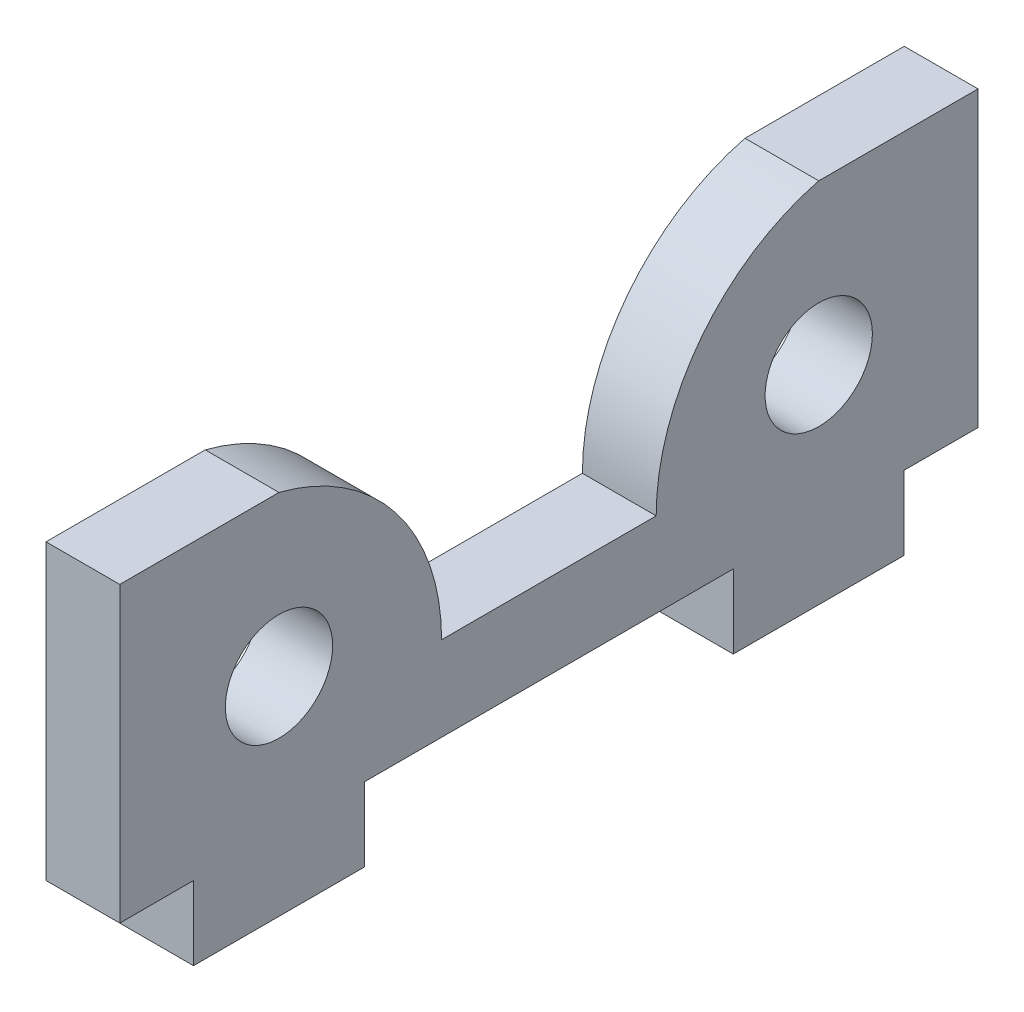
ISO-10303-21;
HEADER;
FILE_DESCRIPTION(('STEP AP214'),'2;1');
FILE_NAME('part.step','',(''),(''),'','','');
FILE_SCHEMA(('AUTOMOTIVE_DESIGN { 1 0 10303 214 1 1 1 1 }'));
ENDSEC;
DATA;
#1=APPLICATION_CONTEXT('core data for automotive mechanical design processes');
#2=APPLICATION_PROTOCOL_DEFINITION('international standard','automotive_design',2000,#1);
#3=PRODUCT_CONTEXT('',#1,'mechanical');
#4=PRODUCT('Part','Part','',(#3));
#5=PRODUCT_RELATED_PRODUCT_CATEGORY('part','',(#4));
#6=PRODUCT_DEFINITION_FORMATION('','',#4);
#7=PRODUCT_DEFINITION_CONTEXT('part definition',#1,'design');
#8=PRODUCT_DEFINITION('design','',#6,#7);
#9=PRODUCT_DEFINITION_SHAPE('','',#8);
#10=(LENGTH_UNIT() NAMED_UNIT(*) SI_UNIT(.MILLI.,.METRE.));
#11=(NAMED_UNIT(*) PLANE_ANGLE_UNIT() SI_UNIT($,.RADIAN.));
#12=(NAMED_UNIT(*) SI_UNIT($,.STERADIAN.) SOLID_ANGLE_UNIT());
#13=UNCERTAINTY_MEASURE_WITH_UNIT(LENGTH_MEASURE(1.E-05),#10,'distance_accuracy_value','');
#14=(GEOMETRIC_REPRESENTATION_CONTEXT(3) GLOBAL_UNCERTAINTY_ASSIGNED_CONTEXT((#13)) GLOBAL_UNIT_ASSIGNED_CONTEXT((#10,
#11,#12)) REPRESENTATION_CONTEXT('',''));
#15=CARTESIAN_POINT('',(0.,0.,0.));
#16=DIRECTION('',(0.,0.,1.));
#17=DIRECTION('',(1.,0.,0.));
#18=AXIS2_PLACEMENT_3D('',#15,#16,#17);
#19=CARTESIAN_POINT('',(5.5,11.8,2.43417525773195));
#20=DIRECTION('',(-1.,0.,0.));
#21=DIRECTION('',(0.,0.,1.));
#22=AXIS2_PLACEMENT_3D('',#19,#20,#21);
#23=CYLINDRICAL_SURFACE('',#22,16.065824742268);
#24=CARTESIAN_POINT('',(0.,11.8,2.43417525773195));
#25=DIRECTION('',(1.,0.,0.));
#26=DIRECTION('',(0.,0.,-1.));
#27=AXIS2_PLACEMENT_3D('',#24,#25,#26);
#28=CIRCLE('',#27,16.065824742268);
#29=CARTESIAN_POINT('',(0.,11.8,18.5));
#30=VERTEX_POINT('',#29);
#31=CARTESIAN_POINT('',(0.,27.375,6.375));
#32=VERTEX_POINT('',#31);
#33=EDGE_CURVE('E187',#30,#32,#28,.F.);
#34=ORIENTED_EDGE('',*,*,#33,.F.);
#35=DIRECTION('',(-1.,0.,0.));
#36=VECTOR('',#35,1.);
#37=CARTESIAN_POINT('',(5.5,11.8,18.5));
#38=LINE('',#37,#36);
#39=CARTESIAN_POINT('',(5.5,11.8,18.5));
#40=VERTEX_POINT('',#39);
#41=EDGE_CURVE('E11',#40,#30,#38,.T.);
#42=ORIENTED_EDGE('',*,*,#41,.F.);
#43=CARTESIAN_POINT('',(5.5,11.8,2.43417525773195));
#44=DIRECTION('',(1.,0.,0.));
#45=DIRECTION('',(0.,0.,-1.));
#46=AXIS2_PLACEMENT_3D('',#43,#44,#45);
#47=CIRCLE('',#46,16.065824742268);
#48=CARTESIAN_POINT('',(5.5,27.375,6.375));
#49=VERTEX_POINT('',#48);
#50=EDGE_CURVE('E227',#40,#49,#47,.F.);
#51=ORIENTED_EDGE('',*,*,#50,.T.);
#52=DIRECTION('',(-1.,0.,0.));
#53=VECTOR('',#52,1.);
#54=CARTESIAN_POINT('',(5.5,27.375,6.375));
#55=LINE('',#54,#53);
#56=EDGE_CURVE('E114',#49,#32,#55,.T.);
#57=ORIENTED_EDGE('',*,*,#56,.T.);
#58=EDGE_LOOP('',(#34,#42,#51,#57));
#59=FACE_BOUND('',#58,.T.);
#60=ADVANCED_FACE('F39',(#59),#23,.T.);
#61=CARTESIAN_POINT('',(5.5,11.8,0.));
#62=DIRECTION('',(0.,-1.,0.));
#63=DIRECTION('',(0.,0.,-1.));
#64=AXIS2_PLACEMENT_3D('',#61,#62,#63);
#65=PLANE('',#64);
#66=DIRECTION('',(0.,0.,1.));
#67=VECTOR('',#66,1.);
#68=CARTESIAN_POINT('',(0.,11.8,0.));
#69=LINE('',#68,#67);
#70=CARTESIAN_POINT('',(0.,11.8,34.5));
#71=VERTEX_POINT('',#70);
#72=EDGE_CURVE('E190',#30,#71,#69,.T.);
#73=ORIENTED_EDGE('',*,*,#72,.T.);
#74=DIRECTION('',(-1.,0.,0.));
#75=VECTOR('',#74,1.);
#76=CARTESIAN_POINT('',(5.5,11.8,34.5));
#77=LINE('',#76,#75);
#78=CARTESIAN_POINT('',(5.5,11.8,34.5));
#79=VERTEX_POINT('',#78);
#80=EDGE_CURVE('E47',#79,#71,#77,.T.);
#81=ORIENTED_EDGE('',*,*,#80,.F.);
#82=DIRECTION('',(0.,0.,1.));
#83=VECTOR('',#82,1.);
#84=CARTESIAN_POINT('',(5.5,11.8,0.));
#85=LINE('',#84,#83);
#86=EDGE_CURVE('E284',#40,#79,#85,.T.);
#87=ORIENTED_EDGE('',*,*,#86,.F.);
#88=ORIENTED_EDGE('',*,*,#41,.T.);
#89=EDGE_LOOP('',(#73,#81,#87,#88));
#90=FACE_BOUND('',#89,.T.);
#91=ADVANCED_FACE('F314',(#90),#65,.F.);
#92=CARTESIAN_POINT('',(5.5,11.8,50.565824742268));
#93=DIRECTION('',(-1.,0.,0.));
#94=DIRECTION('',(0.,0.,1.));
#95=AXIS2_PLACEMENT_3D('',#92,#93,#94);
#96=CYLINDRICAL_SURFACE('',#95,16.065824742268);
#97=CARTESIAN_POINT('',(0.,11.8,50.565824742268));
#98=DIRECTION('',(1.,0.,0.));
#99=DIRECTION('',(0.,0.,-1.));
#100=AXIS2_PLACEMENT_3D('',#97,#98,#99);
#101=CIRCLE('',#100,16.065824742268);
#102=CARTESIAN_POINT('',(0.,27.375,46.625));
#103=VERTEX_POINT('',#102);
#104=EDGE_CURVE('E192',#71,#103,#101,.T.);
#105=ORIENTED_EDGE('',*,*,#104,.T.);
#106=DIRECTION('',(-1.,0.,0.));
#107=VECTOR('',#106,1.);
#108=CARTESIAN_POINT('',(5.5,27.375,46.625));
#109=LINE('',#108,#107);
#110=CARTESIAN_POINT('',(5.5,27.375,46.625));
#111=VERTEX_POINT('',#110);
#112=EDGE_CURVE('E256',#111,#103,#109,.T.);
#113=ORIENTED_EDGE('',*,*,#112,.F.);
#114=CARTESIAN_POINT('',(5.5,11.8,50.565824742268));
#115=DIRECTION('',(1.,0.,0.));
#116=DIRECTION('',(0.,0.,-1.));
#117=AXIS2_PLACEMENT_3D('',#114,#115,#116);
#118=CIRCLE('',#117,16.065824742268);
#119=EDGE_CURVE('E264',#79,#111,#118,.T.);
#120=ORIENTED_EDGE('',*,*,#119,.F.);
#121=ORIENTED_EDGE('',*,*,#80,.T.);
#122=EDGE_LOOP('',(#105,#113,#120,#121));
#123=FACE_BOUND('',#122,.T.);
#124=ADVANCED_FACE('F262',(#123),#96,.T.);
#125=CARTESIAN_POINT('',(5.5,27.375,0.));
#126=DIRECTION('',(0.,1.,0.));
#127=DIRECTION('',(0.,0.,1.));
#128=AXIS2_PLACEMENT_3D('',#125,#126,#127);
#129=PLANE('',#128);
#130=DIRECTION('',(0.,0.,-1.));
#131=VECTOR('',#130,1.);
#132=CARTESIAN_POINT('',(0.,27.375,0.));
#133=LINE('',#132,#131);
#134=CARTESIAN_POINT('',(0.,27.375,58.5));
#135=VERTEX_POINT('',#134);
#136=EDGE_CURVE('E195',#135,#103,#133,.T.);
#137=ORIENTED_EDGE('',*,*,#136,.F.);
#138=DIRECTION('',(-1.,0.,0.));
#139=VECTOR('',#138,1.);
#140=CARTESIAN_POINT('',(5.5,27.375,58.5));
#141=LINE('',#140,#139);
#142=CARTESIAN_POINT('',(5.5,27.375,58.5));
#143=VERTEX_POINT('',#142);
#144=EDGE_CURVE('E254',#143,#135,#141,.T.);
#145=ORIENTED_EDGE('',*,*,#144,.F.);
#146=DIRECTION('',(0.,0.,-1.));
#147=VECTOR('',#146,1.);
#148=CARTESIAN_POINT('',(5.5,27.375,0.));
#149=LINE('',#148,#147);
#150=EDGE_CURVE('E277',#143,#111,#149,.T.);
#151=ORIENTED_EDGE('',*,*,#150,.T.);
#152=ORIENTED_EDGE('',*,*,#112,.T.);
#153=EDGE_LOOP('',(#137,#145,#151,#152));
#154=FACE_BOUND('',#153,.T.);
#155=ADVANCED_FACE('F274',(#154),#129,.T.);
#156=CARTESIAN_POINT('',(5.5,0.,58.5));
#157=DIRECTION('',(0.,0.,1.));
#158=DIRECTION('',(1.,0.,0.));
#159=AXIS2_PLACEMENT_3D('',#156,#157,#158);
#160=PLANE('',#159);
#161=DIRECTION('',(0.,1.,0.));
#162=VECTOR('',#161,1.);
#163=CARTESIAN_POINT('',(0.,0.,58.5));
#164=LINE('',#163,#162);
#165=CARTESIAN_POINT('',(0.,5.5,58.5));
#166=VERTEX_POINT('',#165);
#167=EDGE_CURVE('E198',#166,#135,#164,.T.);
#168=ORIENTED_EDGE('',*,*,#167,.F.);
#169=DIRECTION('',(-1.,0.,0.));
#170=VECTOR('',#169,1.);
#171=CARTESIAN_POINT('',(5.5,5.5,58.5));
#172=LINE('',#171,#170);
#173=CARTESIAN_POINT('',(5.5,5.5,58.5));
#174=VERTEX_POINT('',#173);
#175=EDGE_CURVE('E252',#174,#166,#172,.T.);
#176=ORIENTED_EDGE('',*,*,#175,.F.);
#177=DIRECTION('',(0.,1.,0.));
#178=VECTOR('',#177,1.);
#179=CARTESIAN_POINT('',(5.5,0.,58.5));
#180=LINE('',#179,#178);
#181=EDGE_CURVE('E280',#174,#143,#180,.T.);
#182=ORIENTED_EDGE('',*,*,#181,.T.);
#183=ORIENTED_EDGE('',*,*,#144,.T.);
#184=EDGE_LOOP('',(#168,#176,#182,#183));
#185=FACE_BOUND('',#184,.T.);
#186=ADVANCED_FACE('F324',(#185),#160,.T.);
#187=CARTESIAN_POINT('',(5.5,5.5,0.));
#188=DIRECTION('',(0.,1.,0.));
#189=DIRECTION('',(0.,0.,1.));
#190=AXIS2_PLACEMENT_3D('',#187,#188,#189);
#191=PLANE('',#190);
#192=DIRECTION('',(0.,0.,-1.));
#193=VECTOR('',#192,1.);
#194=CARTESIAN_POINT('',(0.,5.5,0.));
#195=LINE('',#194,#193);
#196=CARTESIAN_POINT('',(0.,5.5,53.));
#197=VERTEX_POINT('',#196);
#198=EDGE_CURVE('E201',#166,#197,#195,.T.);
#199=ORIENTED_EDGE('',*,*,#198,.T.);
#200=DIRECTION('',(-1.,0.,0.));
#201=VECTOR('',#200,1.);
#202=CARTESIAN_POINT('',(5.5,5.5,53.));
#203=LINE('',#202,#201);
#204=CARTESIAN_POINT('',(5.5,5.5,53.));
#205=VERTEX_POINT('',#204);
#206=EDGE_CURVE('E249',#205,#197,#203,.T.);
#207=ORIENTED_EDGE('',*,*,#206,.F.);
#208=DIRECTION('',(0.,0.,-1.));
#209=VECTOR('',#208,1.);
#210=CARTESIAN_POINT('',(5.5,5.5,0.));
#211=LINE('',#210,#209);
#212=EDGE_CURVE('E282',#174,#205,#211,.T.);
#213=ORIENTED_EDGE('',*,*,#212,.F.);
#214=ORIENTED_EDGE('',*,*,#175,.T.);
#215=EDGE_LOOP('',(#199,#207,#213,#214));
#216=FACE_BOUND('',#215,.T.);
#217=ADVANCED_FACE('F327',(#216),#191,.F.);
#218=CARTESIAN_POINT('',(5.5,0.,53.));
#219=DIRECTION('',(0.,0.,-1.));
#220=DIRECTION('',(-1.,0.,0.));
#221=AXIS2_PLACEMENT_3D('',#218,#219,#220);
#222=PLANE('',#221);
#223=DIRECTION('',(0.,-1.,0.));
#224=VECTOR('',#223,1.);
#225=CARTESIAN_POINT('',(0.,0.,53.));
#226=LINE('',#225,#224);
#227=CARTESIAN_POINT('',(0.,0.,53.));
#228=VERTEX_POINT('',#227);
#229=EDGE_CURVE('E203',#197,#228,#226,.T.);
#230=ORIENTED_EDGE('',*,*,#229,.T.);
#231=DIRECTION('',(-1.,0.,0.));
#232=VECTOR('',#231,1.);
#233=CARTESIAN_POINT('',(5.5,0.,53.));
#234=LINE('',#233,#232);
#235=CARTESIAN_POINT('',(5.5,0.,53.));
#236=VERTEX_POINT('',#235);
#237=EDGE_CURVE('E246',#236,#228,#234,.T.);
#238=ORIENTED_EDGE('',*,*,#237,.F.);
#239=DIRECTION('',(0.,-1.,0.));
#240=VECTOR('',#239,1.);
#241=CARTESIAN_POINT('',(5.5,0.,53.));
#242=LINE('',#241,#240);
#243=EDGE_CURVE('E289',#205,#236,#242,.T.);
#244=ORIENTED_EDGE('',*,*,#243,.F.);
#245=ORIENTED_EDGE('',*,*,#206,.T.);
#246=EDGE_LOOP('',(#230,#238,#244,#245));
#247=FACE_BOUND('',#246,.T.);
#248=ADVANCED_FACE('F331',(#247),#222,.F.);
#249=CARTESIAN_POINT('',(5.5,0.,0.));
#250=DIRECTION('',(0.,1.,0.));
#251=DIRECTION('',(0.,0.,1.));
#252=AXIS2_PLACEMENT_3D('',#249,#250,#251);
#253=PLANE('',#252);
#254=DIRECTION('',(0.,0.,-1.));
#255=VECTOR('',#254,1.);
#256=CARTESIAN_POINT('',(0.,0.,0.));
#257=LINE('',#256,#255);
#258=CARTESIAN_POINT('',(0.,0.,40.25));
#259=VERTEX_POINT('',#258);
#260=EDGE_CURVE('E205',#228,#259,#257,.T.);
#261=ORIENTED_EDGE('',*,*,#260,.T.);
#262=DIRECTION('',(-1.,0.,0.));
#263=VECTOR('',#262,1.);
#264=CARTESIAN_POINT('',(5.5,0.,40.25));
#265=LINE('',#264,#263);
#266=CARTESIAN_POINT('',(5.5,0.,40.25));
#267=VERTEX_POINT('',#266);
#268=EDGE_CURVE('E243',#267,#259,#265,.T.);
#269=ORIENTED_EDGE('',*,*,#268,.F.);
#270=DIRECTION('',(0.,0.,-1.));
#271=VECTOR('',#270,1.);
#272=CARTESIAN_POINT('',(5.5,0.,0.));
#273=LINE('',#272,#271);
#274=EDGE_CURVE('E291',#236,#267,#273,.T.);
#275=ORIENTED_EDGE('',*,*,#274,.F.);
#276=ORIENTED_EDGE('',*,*,#237,.T.);
#277=EDGE_LOOP('',(#261,#269,#275,#276));
#278=FACE_BOUND('',#277,.T.);
#279=ADVANCED_FACE('F335',(#278),#253,.F.);
#280=CARTESIAN_POINT('',(5.5,0.,40.25));
#281=DIRECTION('',(0.,0.,1.));
#282=DIRECTION('',(1.,0.,0.));
#283=AXIS2_PLACEMENT_3D('',#280,#281,#282);
#284=PLANE('',#283);
#285=DIRECTION('',(0.,1.,0.));
#286=VECTOR('',#285,1.);
#287=CARTESIAN_POINT('',(0.,0.,40.25));
#288=LINE('',#287,#286);
#289=CARTESIAN_POINT('',(0.,5.5,40.25));
#290=VERTEX_POINT('',#289);
#291=EDGE_CURVE('E207',#259,#290,#288,.T.);
#292=ORIENTED_EDGE('',*,*,#291,.T.);
#293=DIRECTION('',(-1.,0.,0.));
#294=VECTOR('',#293,1.);
#295=CARTESIAN_POINT('',(5.5,5.5,40.25));
#296=LINE('',#295,#294);
#297=CARTESIAN_POINT('',(5.5,5.5,40.25));
#298=VERTEX_POINT('',#297);
#299=EDGE_CURVE('E240',#298,#290,#296,.T.);
#300=ORIENTED_EDGE('',*,*,#299,.F.);
#301=DIRECTION('',(0.,1.,0.));
#302=VECTOR('',#301,1.);
#303=CARTESIAN_POINT('',(5.5,0.,40.25));
#304=LINE('',#303,#302);
#305=EDGE_CURVE('E293',#267,#298,#304,.T.);
#306=ORIENTED_EDGE('',*,*,#305,.F.);
#307=ORIENTED_EDGE('',*,*,#268,.T.);
#308=EDGE_LOOP('',(#292,#300,#306,#307));
#309=FACE_BOUND('',#308,.T.);
#310=ADVANCED_FACE('F339',(#309),#284,.F.);
#311=CARTESIAN_POINT('',(5.5,5.5,0.));
#312=DIRECTION('',(0.,1.,0.));
#313=DIRECTION('',(0.,0.,1.));
#314=AXIS2_PLACEMENT_3D('',#311,#312,#313);
#315=PLANE('',#314);
#316=DIRECTION('',(0.,0.,-1.));
#317=VECTOR('',#316,1.);
#318=CARTESIAN_POINT('',(0.,5.5,0.));
#319=LINE('',#318,#317);
#320=CARTESIAN_POINT('',(0.,5.5,12.75));
#321=VERTEX_POINT('',#320);
#322=EDGE_CURVE('E209',#290,#321,#319,.T.);
#323=ORIENTED_EDGE('',*,*,#322,.T.);
#324=DIRECTION('',(-1.,0.,0.));
#325=VECTOR('',#324,1.);
#326=CARTESIAN_POINT('',(5.5,5.5,12.75));
#327=LINE('',#326,#325);
#328=CARTESIAN_POINT('',(5.5,5.5,12.75));
#329=VERTEX_POINT('',#328);
#330=EDGE_CURVE('E237',#329,#321,#327,.T.);
#331=ORIENTED_EDGE('',*,*,#330,.F.);
#332=DIRECTION('',(0.,0.,-1.));
#333=VECTOR('',#332,1.);
#334=CARTESIAN_POINT('',(5.5,5.5,0.));
#335=LINE('',#334,#333);
#336=EDGE_CURVE('E295',#298,#329,#335,.T.);
#337=ORIENTED_EDGE('',*,*,#336,.F.);
#338=ORIENTED_EDGE('',*,*,#299,.T.);
#339=EDGE_LOOP('',(#323,#331,#337,#338));
#340=FACE_BOUND('',#339,.T.);
#341=ADVANCED_FACE('F343',(#340),#315,.F.);
#342=CARTESIAN_POINT('',(5.5,0.,12.75));
#343=DIRECTION('',(0.,0.,-1.));
#344=DIRECTION('',(0.,1.,0.));
#345=AXIS2_PLACEMENT_3D('',#342,#343,#344);
#346=PLANE('',#345);
#347=DIRECTION('',(0.,-1.,0.));
#348=VECTOR('',#347,1.);
#349=CARTESIAN_POINT('',(0.,0.,12.75));
#350=LINE('',#349,#348);
#351=CARTESIAN_POINT('',(0.,0.,12.75));
#352=VERTEX_POINT('',#351);
#353=EDGE_CURVE('E211',#321,#352,#350,.T.);
#354=ORIENTED_EDGE('',*,*,#353,.T.);
#355=DIRECTION('',(-1.,0.,0.));
#356=VECTOR('',#355,1.);
#357=CARTESIAN_POINT('',(5.5,0.,12.75));
#358=LINE('',#357,#356);
#359=CARTESIAN_POINT('',(5.5,0.,12.75));
#360=VERTEX_POINT('',#359);
#361=EDGE_CURVE('E234',#360,#352,#358,.T.);
#362=ORIENTED_EDGE('',*,*,#361,.F.);
#363=DIRECTION('',(0.,-1.,0.));
#364=VECTOR('',#363,1.);
#365=CARTESIAN_POINT('',(5.5,0.,12.75));
#366=LINE('',#365,#364);
#367=EDGE_CURVE('E297',#329,#360,#366,.T.);
#368=ORIENTED_EDGE('',*,*,#367,.F.);
#369=ORIENTED_EDGE('',*,*,#330,.T.);
#370=EDGE_LOOP('',(#354,#362,#368,#369));
#371=FACE_BOUND('',#370,.T.);
#372=ADVANCED_FACE('F347',(#371),#346,.F.);
#373=CARTESIAN_POINT('',(5.5,0.,0.));
#374=DIRECTION('',(0.,1.,0.));
#375=DIRECTION('',(0.,0.,1.));
#376=AXIS2_PLACEMENT_3D('',#373,#374,#375);
#377=PLANE('',#376);
#378=DIRECTION('',(0.,0.,-1.));
#379=VECTOR('',#378,1.);
#380=CARTESIAN_POINT('',(0.,0.,0.));
#381=LINE('',#380,#379);
#382=CARTESIAN_POINT('',(0.,0.,0.));
#383=VERTEX_POINT('',#382);
#384=EDGE_CURVE('E213',#352,#383,#381,.T.);
#385=ORIENTED_EDGE('',*,*,#384,.T.);
#386=DIRECTION('',(-1.,0.,0.));
#387=VECTOR('',#386,1.);
#388=CARTESIAN_POINT('',(5.5,0.,0.));
#389=LINE('',#388,#387);
#390=CARTESIAN_POINT('',(5.5,0.,0.));
#391=VERTEX_POINT('',#390);
#392=EDGE_CURVE('E231',#391,#383,#389,.T.);
#393=ORIENTED_EDGE('',*,*,#392,.F.);
#394=DIRECTION('',(0.,0.,-1.));
#395=VECTOR('',#394,1.);
#396=CARTESIAN_POINT('',(5.5,0.,0.));
#397=LINE('',#396,#395);
#398=EDGE_CURVE('E299',#360,#391,#397,.T.);
#399=ORIENTED_EDGE('',*,*,#398,.F.);
#400=ORIENTED_EDGE('',*,*,#361,.T.);
#401=EDGE_LOOP('',(#385,#393,#399,#400));
#402=FACE_BOUND('',#401,.T.);
#403=ADVANCED_FACE('F305',(#402),#377,.F.);
#404=CARTESIAN_POINT('',(5.5,0.,0.));
#405=DIRECTION('',(0.,0.,1.));
#406=DIRECTION('',(1.,0.,0.));
#407=AXIS2_PLACEMENT_3D('',#404,#405,#406);
#408=PLANE('',#407);
#409=DIRECTION('',(0.,1.,0.));
#410=VECTOR('',#409,1.);
#411=CARTESIAN_POINT('',(0.,0.,0.));
#412=LINE('',#411,#410);
#413=CARTESIAN_POINT('',(0.,5.5,0.));
#414=VERTEX_POINT('',#413);
#415=EDGE_CURVE('E215',#383,#414,#412,.T.);
#416=ORIENTED_EDGE('',*,*,#415,.T.);
#417=DIRECTION('',(-1.,0.,0.));
#418=VECTOR('',#417,1.);
#419=CARTESIAN_POINT('',(5.5,5.5,0.));
#420=LINE('',#419,#418);
#421=CARTESIAN_POINT('',(5.5,5.5,0.));
#422=VERTEX_POINT('',#421);
#423=EDGE_CURVE('E173',#422,#414,#420,.T.);
#424=ORIENTED_EDGE('',*,*,#423,.F.);
#425=DIRECTION('',(0.,1.,0.));
#426=VECTOR('',#425,1.);
#427=CARTESIAN_POINT('',(5.5,0.,0.));
#428=LINE('',#427,#426);
#429=EDGE_CURVE('E164',#391,#422,#428,.T.);
#430=ORIENTED_EDGE('',*,*,#429,.F.);
#431=ORIENTED_EDGE('',*,*,#392,.T.);
#432=EDGE_LOOP('',(#416,#424,#430,#431));
#433=FACE_BOUND('',#432,.T.);
#434=ADVANCED_FACE('F309',(#433),#408,.F.);
#435=CARTESIAN_POINT('',(5.5,5.5,0.));
#436=DIRECTION('',(0.,1.,0.));
#437=DIRECTION('',(0.,0.,1.));
#438=AXIS2_PLACEMENT_3D('',#435,#436,#437);
#439=PLANE('',#438);
#440=DIRECTION('',(0.,0.,-1.));
#441=VECTOR('',#440,1.);
#442=CARTESIAN_POINT('',(0.,5.5,0.));
#443=LINE('',#442,#441);
#444=CARTESIAN_POINT('',(0.,5.5,-5.5));
#445=VERTEX_POINT('',#444);
#446=EDGE_CURVE('E172',#414,#445,#443,.T.);
#447=ORIENTED_EDGE('',*,*,#446,.T.);
#448=DIRECTION('',(-1.,0.,0.));
#449=VECTOR('',#448,1.);
#450=CARTESIAN_POINT('',(5.5,5.5,-5.5));
#451=LINE('',#450,#449);
#452=CARTESIAN_POINT('',(5.5,5.5,-5.5));
#453=VERTEX_POINT('',#452);
#454=EDGE_CURVE('E169',#453,#445,#451,.T.);
#455=ORIENTED_EDGE('',*,*,#454,.F.);
#456=DIRECTION('',(0.,0.,-1.));
#457=VECTOR('',#456,1.);
#458=CARTESIAN_POINT('',(5.5,5.5,0.));
#459=LINE('',#458,#457);
#460=EDGE_CURVE('E157',#422,#453,#459,.T.);
#461=ORIENTED_EDGE('',*,*,#460,.F.);
#462=ORIENTED_EDGE('',*,*,#423,.T.);
#463=EDGE_LOOP('',(#447,#455,#461,#462));
#464=FACE_BOUND('',#463,.T.);
#465=ADVANCED_FACE('F170',(#464),#439,.F.);
#466=CARTESIAN_POINT('',(5.5,0.,-5.5));
#467=DIRECTION('',(0.,0.,1.));
#468=DIRECTION('',(1.,0.,0.));
#469=AXIS2_PLACEMENT_3D('',#466,#467,#468);
#470=PLANE('',#469);
#471=DIRECTION('',(0.,1.,0.));
#472=VECTOR('',#471,1.);
#473=CARTESIAN_POINT('',(0.,0.,-5.5));
#474=LINE('',#473,#472);
#475=CARTESIAN_POINT('',(0.,27.375,-5.5));
#476=VERTEX_POINT('',#475);
#477=EDGE_CURVE('E107',#445,#476,#474,.T.);
#478=ORIENTED_EDGE('',*,*,#477,.T.);
#479=DIRECTION('',(-1.,0.,0.));
#480=VECTOR('',#479,1.);
#481=CARTESIAN_POINT('',(5.5,27.375,-5.5));
#482=LINE('',#481,#480);
#483=CARTESIAN_POINT('',(5.5,27.375,-5.5));
#484=VERTEX_POINT('',#483);
#485=EDGE_CURVE('E174',#484,#476,#482,.T.);
#486=ORIENTED_EDGE('',*,*,#485,.F.);
#487=DIRECTION('',(0.,1.,0.));
#488=VECTOR('',#487,1.);
#489=CARTESIAN_POINT('',(5.5,0.,-5.5));
#490=LINE('',#489,#488);
#491=EDGE_CURVE('E162',#453,#484,#490,.T.);
#492=ORIENTED_EDGE('',*,*,#491,.F.);
#493=ORIENTED_EDGE('',*,*,#454,.T.);
#494=EDGE_LOOP('',(#478,#486,#492,#493));
#495=FACE_BOUND('',#494,.T.);
#496=ADVANCED_FACE('F176',(#495),#470,.F.);
#497=CARTESIAN_POINT('',(5.5,15.5,6.375));
#498=DIRECTION('',(-1.,0.,0.));
#499=DIRECTION('',(0.,0.,1.));
#500=AXIS2_PLACEMENT_3D('',#497,#498,#499);
#501=CYLINDRICAL_SURFACE('',#500,4.);
#502=CARTESIAN_POINT('',(5.5,15.5,6.375));
#503=DIRECTION('',(1.,0.,0.));
#504=DIRECTION('',(0.,0.,-1.));
#505=AXIS2_PLACEMENT_3D('',#502,#503,#504);
#506=CIRCLE('',#505,4.);
#507=CARTESIAN_POINT('',(5.5,15.5,2.375));
#508=VERTEX_POINT('',#507);
#509=EDGE_CURVE('E178',#508,#508,#506,.T.);
#510=ORIENTED_EDGE('',*,*,#509,.T.);
#511=EDGE_LOOP('',(#510));
#512=FACE_BOUND('',#511,.T.);
#513=CARTESIAN_POINT('',(0.,15.5,6.375));
#514=DIRECTION('',(1.,0.,0.));
#515=DIRECTION('',(0.,0.,-1.));
#516=AXIS2_PLACEMENT_3D('',#513,#514,#515);
#517=CIRCLE('',#516,4.);
#518=CARTESIAN_POINT('',(0.,15.5,2.375));
#519=VERTEX_POINT('',#518);
#520=EDGE_CURVE('E221',#519,#519,#517,.T.);
#521=ORIENTED_EDGE('',*,*,#520,.F.);
#522=EDGE_LOOP('',(#521));
#523=FACE_BOUND('',#522,.T.);
#524=ADVANCED_FACE('F360',(#512,#523),#501,.F.);
#525=CARTESIAN_POINT('',(5.5,27.375,0.));
#526=DIRECTION('',(0.,-1.,0.));
#527=DIRECTION('',(0.,0.,-1.));
#528=AXIS2_PLACEMENT_3D('',#525,#526,#527);
#529=PLANE('',#528);
#530=DIRECTION('',(0.,0.,1.));
#531=VECTOR('',#530,1.);
#532=CARTESIAN_POINT('',(0.,27.375,0.));
#533=LINE('',#532,#531);
#534=EDGE_CURVE('E219',#476,#32,#533,.T.);
#535=ORIENTED_EDGE('',*,*,#534,.T.);
#536=ORIENTED_EDGE('',*,*,#56,.F.);
#537=DIRECTION('',(0.,0.,1.));
#538=VECTOR('',#537,1.);
#539=CARTESIAN_POINT('',(5.5,27.375,0.));
#540=LINE('',#539,#538);
#541=EDGE_CURVE('E55',#484,#49,#540,.T.);
#542=ORIENTED_EDGE('',*,*,#541,.F.);
#543=ORIENTED_EDGE('',*,*,#485,.T.);
#544=EDGE_LOOP('',(#535,#536,#542,#543));
#545=FACE_BOUND('',#544,.T.);
#546=ADVANCED_FACE('F312',(#545),#529,.F.);
#547=CARTESIAN_POINT('',(5.5,15.5,46.625));
#548=DIRECTION('',(-1.,0.,0.));
#549=DIRECTION('',(0.,0.,1.));
#550=AXIS2_PLACEMENT_3D('',#547,#548,#549);
#551=CYLINDRICAL_SURFACE('',#550,4.);
#552=CARTESIAN_POINT('',(5.5,15.5,46.625));
#553=DIRECTION('',(1.,0.,0.));
#554=DIRECTION('',(0.,0.,-1.));
#555=AXIS2_PLACEMENT_3D('',#552,#553,#554);
#556=CIRCLE('',#555,4.);
#557=CARTESIAN_POINT('',(5.5,15.5,42.625));
#558=VERTEX_POINT('',#557);
#559=EDGE_CURVE('E184',#558,#558,#556,.T.);
#560=ORIENTED_EDGE('',*,*,#559,.T.);
#561=EDGE_LOOP('',(#560));
#562=FACE_BOUND('',#561,.T.);
#563=CARTESIAN_POINT('',(0.,15.5,46.625));
#564=DIRECTION('',(1.,0.,0.));
#565=DIRECTION('',(0.,0.,-1.));
#566=AXIS2_PLACEMENT_3D('',#563,#564,#565);
#567=CIRCLE('',#566,4.);
#568=CARTESIAN_POINT('',(0.,15.5,42.625));
#569=VERTEX_POINT('',#568);
#570=EDGE_CURVE('E224',#569,#569,#567,.T.);
#571=ORIENTED_EDGE('',*,*,#570,.F.);
#572=EDGE_LOOP('',(#571));
#573=FACE_BOUND('',#572,.T.);
#574=ADVANCED_FACE('F363',(#562,#573),#551,.F.);
#575=CARTESIAN_POINT('',(5.5,0.,0.));
#576=DIRECTION('',(1.,0.,0.));
#577=DIRECTION('',(0.,0.,-1.));
#578=AXIS2_PLACEMENT_3D('',#575,#576,#577);
#579=PLANE('',#578);
#580=ORIENTED_EDGE('',*,*,#50,.F.);
#581=ORIENTED_EDGE('',*,*,#86,.T.);
#582=ORIENTED_EDGE('',*,*,#119,.T.);
#583=ORIENTED_EDGE('',*,*,#150,.F.);
#584=ORIENTED_EDGE('',*,*,#181,.F.);
#585=ORIENTED_EDGE('',*,*,#212,.T.);
#586=ORIENTED_EDGE('',*,*,#243,.T.);
#587=ORIENTED_EDGE('',*,*,#274,.T.);
#588=ORIENTED_EDGE('',*,*,#305,.T.);
#589=ORIENTED_EDGE('',*,*,#336,.T.);
#590=ORIENTED_EDGE('',*,*,#367,.T.);
#591=ORIENTED_EDGE('',*,*,#398,.T.);
#592=ORIENTED_EDGE('',*,*,#429,.T.);
#593=ORIENTED_EDGE('',*,*,#460,.T.);
#594=ORIENTED_EDGE('',*,*,#491,.T.);
#595=ORIENTED_EDGE('',*,*,#541,.T.);
#596=EDGE_LOOP('',(#580,#581,#582,#583,#584,#585,#586,#587,#588,#589,#590,#591,#592,#593,#594,#595));
#597=FACE_BOUND('',#596,.T.);
#598=ORIENTED_EDGE('',*,*,#509,.F.);
#599=EDGE_LOOP('',(#598));
#600=FACE_BOUND('',#599,.T.);
#601=ORIENTED_EDGE('',*,*,#559,.F.);
#602=EDGE_LOOP('',(#601));
#603=FACE_BOUND('',#602,.T.);
#604=ADVANCED_FACE('F159',(#597,#600,#603),#579,.T.);
#605=CARTESIAN_POINT('',(0.,0.,0.));
#606=DIRECTION('',(1.,0.,0.));
#607=DIRECTION('',(0.,0.,-1.));
#608=AXIS2_PLACEMENT_3D('',#605,#606,#607);
#609=PLANE('',#608);
#610=ORIENTED_EDGE('',*,*,#33,.T.);
#611=ORIENTED_EDGE('',*,*,#534,.F.);
#612=ORIENTED_EDGE('',*,*,#477,.F.);
#613=ORIENTED_EDGE('',*,*,#446,.F.);
#614=ORIENTED_EDGE('',*,*,#415,.F.);
#615=ORIENTED_EDGE('',*,*,#384,.F.);
#616=ORIENTED_EDGE('',*,*,#353,.F.);
#617=ORIENTED_EDGE('',*,*,#322,.F.);
#618=ORIENTED_EDGE('',*,*,#291,.F.);
#619=ORIENTED_EDGE('',*,*,#260,.F.);
#620=ORIENTED_EDGE('',*,*,#229,.F.);
#621=ORIENTED_EDGE('',*,*,#198,.F.);
#622=ORIENTED_EDGE('',*,*,#167,.T.);
#623=ORIENTED_EDGE('',*,*,#136,.T.);
#624=ORIENTED_EDGE('',*,*,#104,.F.);
#625=ORIENTED_EDGE('',*,*,#72,.F.);
#626=EDGE_LOOP('',(#610,#611,#612,#613,#614,#615,#616,#617,#618,#619,#620,#621,#622,#623,#624,#625));
#627=FACE_BOUND('',#626,.T.);
#628=ORIENTED_EDGE('',*,*,#520,.T.);
#629=EDGE_LOOP('',(#628));
#630=FACE_BOUND('',#629,.T.);
#631=ORIENTED_EDGE('',*,*,#570,.T.);
#632=EDGE_LOOP('',(#631));
#633=FACE_BOUND('',#632,.T.);
#634=ADVANCED_FACE('F268',(#627,#630,#633),#609,.F.);
#635=CLOSED_SHELL('',(#60,#91,#124,#155,#186,#217,#248,#279,#310,#341,#372,#403,#434,#465,#496,
#524,#546,#574,#604,#634));
#636=MANIFOLD_SOLID_BREP('B2',#635);
#637=ADVANCED_BREP_SHAPE_REPRESENTATION('',(#18,#636),#14);
#638=SHAPE_DEFINITION_REPRESENTATION(#9,#637);
ENDSEC;
END-ISO-10303-21;
